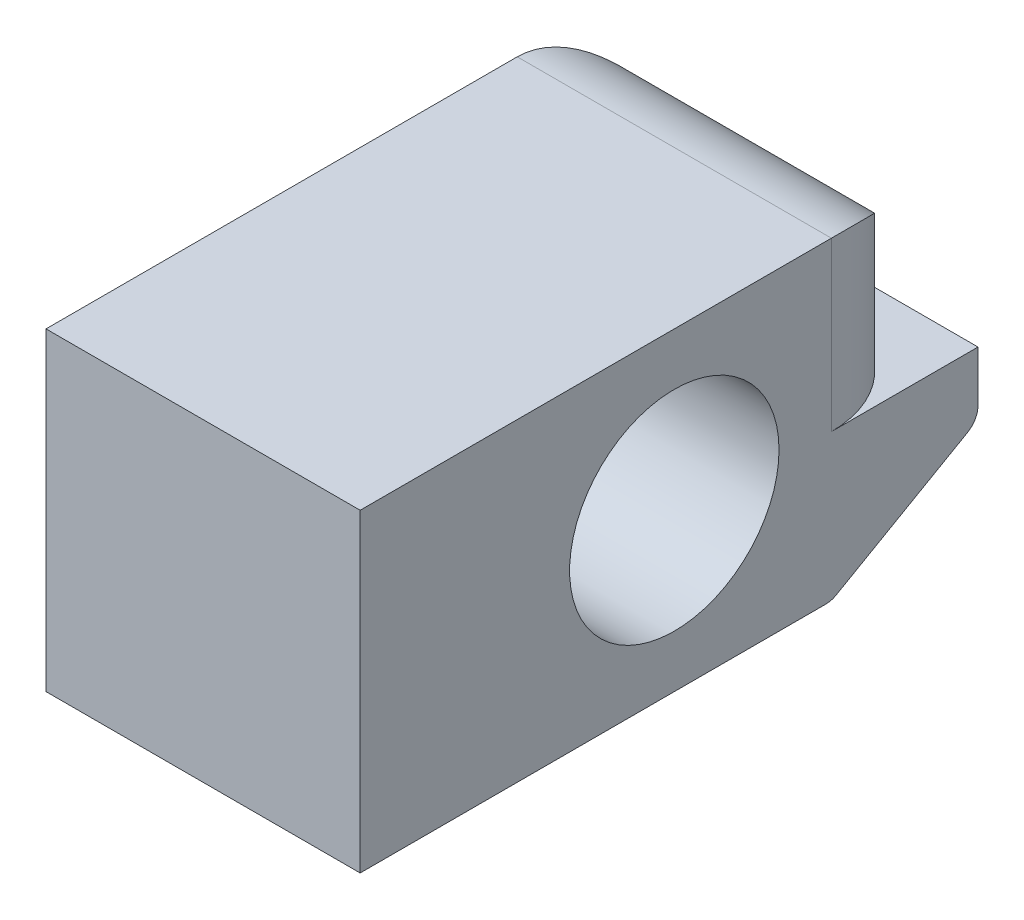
from build123d import *

# Parameters (mm, degrees)
SKETCH1_W               = 3
SKETCH1_H               = 5.5
BOSS_EXTRUDE1_DEPTH     = 3
FILLET1_R               = 1
CUT_EXTRUDE2_DEPTH      = 7.946221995
CUT_EXTRUDE2_DEPTH_BACK = 7.946221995
SKETCH2_R               = 1
BOSS_EXTRUDE5_REACH     = 9.267
SKETCH7_W               = 3
SKETCH7_H               = 0.6
SKETCH8_W               = 0.979795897
SKETCH8_H               = 0.8
CUT_EXTRUDE3_DEPTH      = 10
BOSS_EXTRUDE6_DEPTH     = 3
FILLET2_R               = 0.2


with BuildPart() as part:
    # Sketch1 → Boss-Extrude1 (new body)
    with BuildSketch(Plane(origin=(0, 0, 0), x_dir=(1, 0, 0), z_dir=(0, 1, 0))):
        with Locations((1.5, 2.75)):
            Rectangle(SKETCH1_W, SKETCH1_H)
    extrude(amount=BOSS_EXTRUDE1_DEPTH)

    # Fillet1
    fillet1_edges = [part.edges().sort_by_distance(p)[0] for p in [
        (1.5, 3, -5.5),
        (1.5, 0, -5.5),
        (0, 1.5, -5.5),
        (3, 1.5, -5.5),
    ]]
    fillet(fillet1_edges, radius=FILLET1_R)

    # Sketch2 → Cut-Extrude2 (cut, two sides: drawn at the far end of the back side and taken through both)
    with BuildSketch(Plane(origin=(0, 0, 0), x_dir=(0, 0, -1), z_dir=(1, 0, 0)).offset(-CUT_EXTRUDE2_DEPTH_BACK)):
        with Locations((3, 1.5)):
            Circle(SKETCH2_R)
    extrude(amount=CUT_EXTRUDE2_DEPTH + CUT_EXTRUDE2_DEPTH_BACK, mode=Mode.SUBTRACT)

    # Sketch7 → Boss-Extrude5 (add, up to next)
    with BuildSketch(Plane(origin=(0, 0, -5.9), x_dir=(-1, 0, 0), z_dir=(0, 0, -1)), mode=Mode.PRIVATE) as boss_extrude5_sk1:
        with Locations((-1.5, 1.1)):
            Rectangle(SKETCH7_W, SKETCH7_H)
    boss_extrude5_tool1 = extrude(boss_extrude5_sk1.sketch, amount=-BOSS_EXTRUDE5_REACH, mode=Mode.PRIVATE) - part.part
    add(boss_extrude5_tool1.solids().sort_by_distance((1.5, 1.1, -5.9))[0])

    # Sketch8 → Cut-Extrude3 (cut)
    with BuildSketch(Plane(origin=(3, 0, 0), x_dir=(0, 0, -1), z_dir=(1, 0, 0))):
        with Locations((4.989897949, 0.4)):
            Rectangle(SKETCH8_W, SKETCH8_H)
    extrude(amount=-CUT_EXTRUDE3_DEPTH, mode=Mode.SUBTRACT)

    # Sketch9 → Boss-Extrude6 (add)
    with BuildSketch(Plane(origin=(3, 0, 0), x_dir=(0, 0, -1), z_dir=(1, 0, 0))):
        Polygon((4.5, 0.8), (4.5, 0), (5.9, 0.8), align=None)
    extrude(amount=-BOSS_EXTRUDE6_DEPTH)

    # Fillet2
    fillet2_edges = [part.edges().sort_by_distance(p)[0] for p in [
        (1.5, 0, -4.5),
        (1.5, 0.8, -5.9),
    ]]
    fillet(fillet2_edges, radius=FILLET2_R)


solid = part.part
